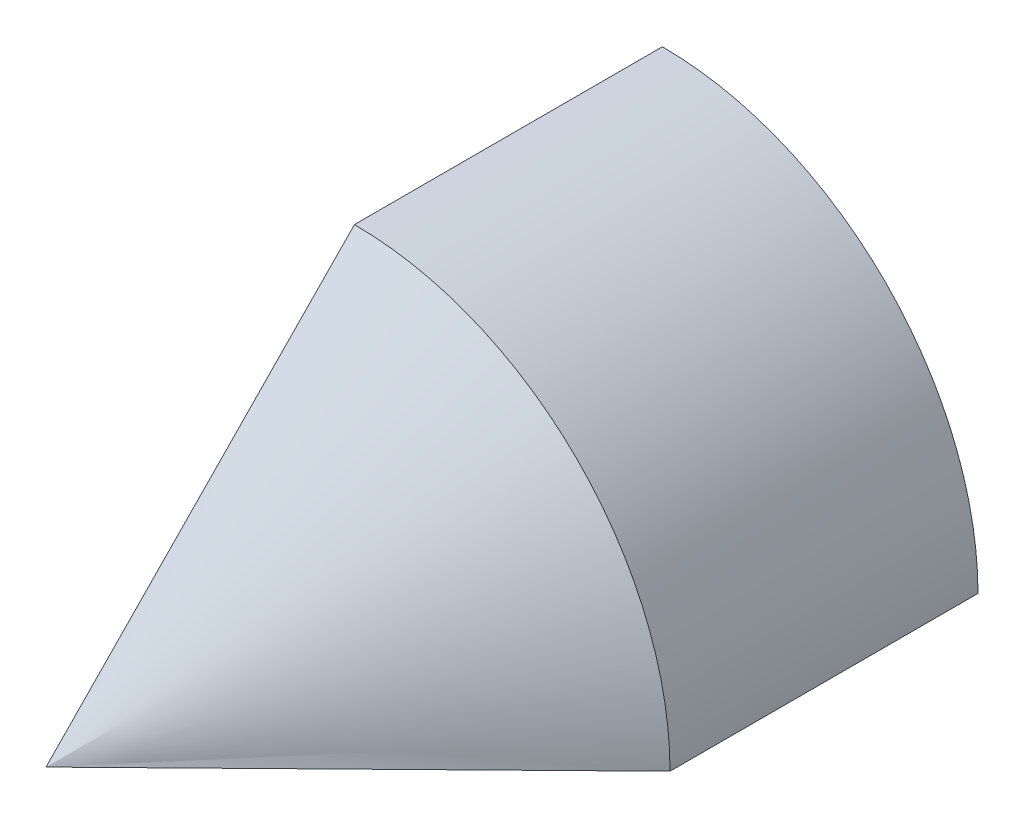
from build123d import *

# Parameters (mm, degrees)
REVOLVE_1_ANGLE = 90


with BuildPart() as part:
    # Sketch 1 → Revolve 1 (revolve)
    with BuildSketch(Plane(origin=(0, 0, 0), x_dir=(0, 0, -1), z_dir=(1, 0, 0))):
        Polygon((-39.194281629, 0), (0.831767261, 40.961236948), (40.800604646, 40.961236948), (40.800604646, 0), align=None)
    revolve(axis=Axis((0, 0, 51.081071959), (0, 0, -1)), revolution_arc=REVOLVE_1_ANGLE)


solid = part.part
